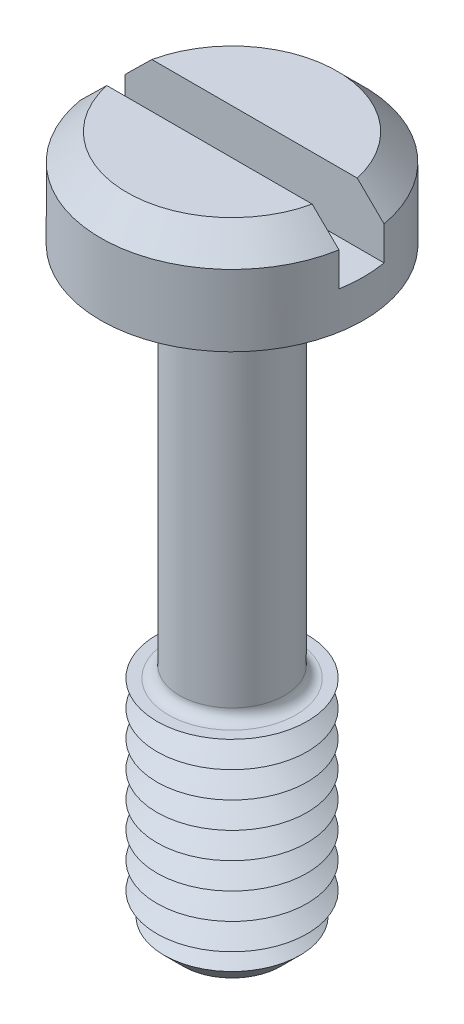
ISO-10303-21;
HEADER;
FILE_DESCRIPTION(('STEP AP214'),'2;1');
FILE_NAME('part.step','',(''),(''),'','','');
FILE_SCHEMA(('AUTOMOTIVE_DESIGN { 1 0 10303 214 1 1 1 1 }'));
ENDSEC;
DATA;
#1=APPLICATION_CONTEXT('core data for automotive mechanical design processes');
#2=APPLICATION_PROTOCOL_DEFINITION('international standard','automotive_design',2000,#1);
#3=PRODUCT_CONTEXT('',#1,'mechanical');
#4=PRODUCT('Part','Part','',(#3));
#5=PRODUCT_RELATED_PRODUCT_CATEGORY('part','',(#4));
#6=PRODUCT_DEFINITION_FORMATION('','',#4);
#7=PRODUCT_DEFINITION_CONTEXT('part definition',#1,'design');
#8=PRODUCT_DEFINITION('design','',#6,#7);
#9=PRODUCT_DEFINITION_SHAPE('','',#8);
#10=(LENGTH_UNIT() NAMED_UNIT(*) SI_UNIT(.MILLI.,.METRE.));
#11=(NAMED_UNIT(*) PLANE_ANGLE_UNIT() SI_UNIT($,.RADIAN.));
#12=(NAMED_UNIT(*) SI_UNIT($,.STERADIAN.) SOLID_ANGLE_UNIT());
#13=UNCERTAINTY_MEASURE_WITH_UNIT(LENGTH_MEASURE(1.E-05),#10,'distance_accuracy_value','');
#14=(GEOMETRIC_REPRESENTATION_CONTEXT(3) GLOBAL_UNCERTAINTY_ASSIGNED_CONTEXT((#13)) GLOBAL_UNIT_ASSIGNED_CONTEXT((#10,
#11,#12)) REPRESENTATION_CONTEXT('',''));
#15=CARTESIAN_POINT('',(0.,0.,0.));
#16=DIRECTION('',(0.,0.,1.));
#17=DIRECTION('',(1.,0.,0.));
#18=AXIS2_PLACEMENT_3D('',#15,#16,#17);
#19=CARTESIAN_POINT('',(0.,2.6,0.));
#20=DIRECTION('',(0.,1.,0.));
#21=DIRECTION('',(0.,0.,1.));
#22=AXIS2_PLACEMENT_3D('',#19,#20,#21);
#23=PLANE('',#22);
#24=DIRECTION('',(-1.,0.,0.));
#25=VECTOR('',#24,1.);
#26=CARTESIAN_POINT('',(3.5,2.6,-0.6));
#27=LINE('',#26,#25);
#28=CARTESIAN_POINT('',(2.73495886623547,2.6,-0.6));
#29=VERTEX_POINT('',#28);
#30=CARTESIAN_POINT('',(-2.73495886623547,2.6,-0.6));
#31=VERTEX_POINT('',#30);
#32=EDGE_CURVE('E110',#29,#31,#27,.T.);
#33=ORIENTED_EDGE('',*,*,#32,.F.);
#34=CARTESIAN_POINT('',(0.,2.6,0.));
#35=DIRECTION('',(0.,1.,0.));
#36=DIRECTION('',(0.,0.,1.));
#37=AXIS2_PLACEMENT_3D('',#34,#35,#36);
#38=CIRCLE('',#37,2.8);
#39=EDGE_CURVE('E113',#29,#31,#38,.T.);
#40=ORIENTED_EDGE('',*,*,#39,.T.);
#41=EDGE_LOOP('',(#33,#40));
#42=FACE_BOUND('',#41,.T.);
#43=ADVANCED_FACE('F39',(#42),#23,.T.);
#44=CARTESIAN_POINT('',(0.,2.6,0.));
#45=DIRECTION('',(0.,-1.,0.));
#46=DIRECTION('',(0.,0.,-1.));
#47=AXIS2_PLACEMENT_3D('',#44,#45,#46);
#48=CONICAL_SURFACE('',#47,2.8,0.785398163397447);
#49=CARTESIAN_POINT('',(7.69779986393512,-2.32114776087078,-0.6));
#50=CARTESIAN_POINT('',(7.42456340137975,-2.0487448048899,-0.6));
#51=CARTESIAN_POINT('',(7.15128998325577,-1.77637887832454,-0.6));
#52=CARTESIAN_POINT('',(6.60460779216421,-1.23176088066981,-0.6));
#53=CARTESIAN_POINT('',(6.3311990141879,-0.959508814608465,-0.6));
#54=CARTESIAN_POINT('',(5.78393918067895,-0.414914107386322,-0.6));
#55=CARTESIAN_POINT('',(5.51008795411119,-0.142571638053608,-0.6));
#56=CARTESIAN_POINT('',(4.96212493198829,0.401829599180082,-0.6));
#57=CARTESIAN_POINT('',(4.68801314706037,0.673888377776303,-0.6));
#58=CARTESIAN_POINT('',(4.15230810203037,1.20471714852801,-0.6));
#59=CARTESIAN_POINT('',(3.89073524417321,1.46350771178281,-0.6));
#60=CARTESIAN_POINT('',(3.49781694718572,1.85115830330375,-0.6));
#61=CARTESIAN_POINT('',(3.36674319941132,1.98029362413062,-0.6));
#62=CARTESIAN_POINT('',(3.10433907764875,2.23830030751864,-0.6));
#63=CARTESIAN_POINT('',(2.97300870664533,2.36717167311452,-0.6));
#64=CARTESIAN_POINT('',(2.71005235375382,2.62445652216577,-0.6));
#65=CARTESIAN_POINT('',(2.57842659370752,2.7528702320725,-0.6));
#66=CARTESIAN_POINT('',(2.31459302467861,3.00911021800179,-0.6));
#67=CARTESIAN_POINT('',(2.1823851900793,3.13693646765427,-0.6));
#68=CARTESIAN_POINT('',(1.91706128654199,3.39159289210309,-0.6));
#69=CARTESIAN_POINT('',(1.78394541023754,3.51842326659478,-0.6));
#70=CARTESIAN_POINT('',(1.5829745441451,3.70728046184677,-0.6));
#71=CARTESIAN_POINT('',(1.51577053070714,3.76999922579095,-0.6));
#72=CARTESIAN_POINT('',(1.38073587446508,3.89475766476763,-0.6));
#73=CARTESIAN_POINT('',(1.31290524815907,3.95679735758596,-0.6));
#74=CARTESIAN_POINT('',(1.20662362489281,4.05253127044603,-0.6));
#75=CARTESIAN_POINT('',(1.16849592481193,4.08658409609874,-0.6));
#76=CARTESIAN_POINT('',(1.09186306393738,4.15427097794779,-0.6));
#77=CARTESIAN_POINT('',(1.05335786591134,4.18790499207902,-0.6));
#78=CARTESIAN_POINT('',(0.975560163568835,4.25487029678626,-0.6));
#79=CARTESIAN_POINT('',(0.93626386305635,4.28819718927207,-0.6));
#80=CARTESIAN_POINT('',(0.857023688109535,4.35405392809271,-0.6));
#81=CARTESIAN_POINT('',(0.81707998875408,4.38658398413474,-0.6));
#82=CARTESIAN_POINT('',(0.735932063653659,4.45080389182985,-0.6));
#83=CARTESIAN_POINT('',(0.694719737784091,4.48248357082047,-0.6));
#84=CARTESIAN_POINT('',(0.611023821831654,4.54411116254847,-0.6));
#85=CARTESIAN_POINT('',(0.568540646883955,4.57405963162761,-0.6));
#86=CARTESIAN_POINT('',(0.482031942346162,4.63104137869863,-0.6));
#87=CARTESIAN_POINT('',(0.438018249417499,4.65809235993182,-0.6));
#88=CARTESIAN_POINT('',(0.347545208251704,4.70764477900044,-0.6));
#89=CARTESIAN_POINT('',(0.301093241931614,4.73015905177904,-0.6));
#90=CARTESIAN_POINT('',(0.216840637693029,4.76288589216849,-0.6));
#91=CARTESIAN_POINT('',(0.179711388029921,4.77476119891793,-0.6));
#92=CARTESIAN_POINT('',(0.104069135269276,4.79214056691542,-0.6));
#93=CARTESIAN_POINT('',(0.0655630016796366,4.79767265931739,-0.6));
#94=CARTESIAN_POINT('',(-0.0121083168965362,4.80113734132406,-0.6));
#95=CARTESIAN_POINT('',(-0.0512762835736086,4.79901215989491,-0.6));
#96=CARTESIAN_POINT('',(-0.128601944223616,4.78758103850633,-0.6));
#97=CARTESIAN_POINT('',(-0.166755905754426,4.77825158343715,-0.6));
#98=CARTESIAN_POINT('',(-0.239985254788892,4.75468984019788,-0.6));
#99=CARTESIAN_POINT('',(-0.275121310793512,4.74063623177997,-0.6));
#100=CARTESIAN_POINT('',(-0.343859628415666,4.70912771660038,-0.6));
#101=CARTESIAN_POINT('',(-0.37745919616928,4.69166709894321,-0.6));
#102=CARTESIAN_POINT('',(-0.443620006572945,4.65431398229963,-0.6));
#103=CARTESIAN_POINT('',(-0.476170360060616,4.63440256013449,-0.6));
#104=CARTESIAN_POINT('',(-0.540208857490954,4.59301144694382,-0.6));
#105=CARTESIAN_POINT('',(-0.571697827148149,4.57153301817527,-0.6));
#106=CARTESIAN_POINT('',(-0.636426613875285,4.5256571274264,-0.6));
#107=CARTESIAN_POINT('',(-0.669598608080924,4.50116466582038,-0.6));
#108=CARTESIAN_POINT('',(-0.735238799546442,4.45125092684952,-0.6));
#109=CARTESIAN_POINT('',(-0.767706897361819,4.42582951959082,-0.6));
#110=CARTESIAN_POINT('',(-0.864340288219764,4.34853769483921,-0.6));
#111=CARTESIAN_POINT('',(-0.927700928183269,4.29566444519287,-0.6));
#112=CARTESIAN_POINT('',(-1.05322030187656,4.18829389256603,-0.6));
#113=CARTESIAN_POINT('',(-1.11537654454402,4.13379371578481,-0.6));
#114=CARTESIAN_POINT('',(-1.23879800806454,4.02383276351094,-0.6));
#115=CARTESIAN_POINT('',(-1.30006349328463,3.96837228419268,-0.6));
#116=CARTESIAN_POINT('',(-1.42182653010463,3.85695373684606,-0.6));
#117=CARTESIAN_POINT('',(-1.48232573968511,3.80099747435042,-0.6));
#118=CARTESIAN_POINT('',(-1.602900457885,3.68862177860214,-0.6));
#119=CARTESIAN_POINT('',(-1.66297593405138,3.63220231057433,-0.6));
#120=CARTESIAN_POINT('',(-1.84259490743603,3.46258196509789,-0.6));
#121=CARTESIAN_POINT('',(-1.96167258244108,3.34888831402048,-0.6));
#122=CARTESIAN_POINT('',(-2.19942862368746,3.12043467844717,-0.6));
#123=CARTESIAN_POINT('',(-2.31810499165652,3.00567262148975,-0.6));
#124=CARTESIAN_POINT('',(-2.55498513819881,2.77566147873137,-0.6));
#125=CARTESIAN_POINT('',(-2.67318891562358,2.66041239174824,-0.6));
#126=CARTESIAN_POINT('',(-3.02733776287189,2.31418176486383,-0.6));
#127=CARTESIAN_POINT('',(-3.26281496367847,2.08272206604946,-0.6));
#128=CARTESIAN_POINT('',(-3.7332660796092,1.61902814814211,-0.6));
#129=CARTESIAN_POINT('',(-3.96823963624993,1.38679356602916,-0.6));
#130=CARTESIAN_POINT('',(-4.43780370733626,0.92194241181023,-0.6));
#131=CARTESIAN_POINT('',(-4.67239422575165,0.6893258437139,-0.6));
#132=CARTESIAN_POINT('',(-5.13982382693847,0.225350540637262,-0.6));
#133=CARTESIAN_POINT('',(-5.37266445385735,-0.00600663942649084,-0.6));
#134=CARTESIAN_POINT('',(-5.83818541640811,-0.468883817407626,-0.6));
#135=CARTESIAN_POINT('',(-6.07086575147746,-0.700403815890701,-0.6));
#136=CARTESIAN_POINT('',(-6.53596926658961,-1.16341429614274,-0.6));
#137=CARTESIAN_POINT('',(-6.76839251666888,-1.39490470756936,-0.6));
#138=CARTESIAN_POINT('',(-7.23315324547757,-1.85796986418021,-0.6));
#139=CARTESIAN_POINT('',(-7.46549072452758,-2.08954460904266,-0.6));
#140=CARTESIAN_POINT('',(-7.69779986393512,-2.32114776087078,-0.6));
#141=B_SPLINE_CURVE_WITH_KNOTS('',3,(#49,#50,#51,#52,#53,#54,#55,#56,#57,#58,#59,#60,#61,#62,
#63,#64,#65,#66,#67,#68,#69,#70,#71,#72,#73,#74,#75,#76,#77,#78,#79,#80,#81,#82,#83,#84,#85,#86,
#87,#88,#89,#90,#91,#92,#93,#94,#95,#96,#97,#98,#99,#100,#101,#102,#103,#104,#105,#106,#107,
#108,#109,#110,#111,#112,#113,#114,#115,#116,#117,#118,#119,#120,#121,#122,#123,#124,#125,#126,
#127,#128,#129,#130,#131,#132,#133,#134,#135,#136,#137,#138,#139,#140),.UNSPECIFIED.,.F.,.F.,(4,
2,2,2,2,2,2,2,2,2,2,2,2,2,2,2,2,2,2,2,2,2,2,2,2,2,2,2,2,2,2,2,2,2,2,2,2,2,2,2,2,2,2,2,2,4),(0.,
1.15747738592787,2.31500139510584,3.47365747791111,4.63226817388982,5.73614050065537,
6.28814234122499,6.84013779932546,7.39180548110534,7.94349768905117,8.49507629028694,
8.77084567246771,9.04660781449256,9.19996738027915,9.35334222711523,9.50791164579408,
9.66243993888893,9.81835637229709,9.9742224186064,10.1290741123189,10.2834813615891,
10.4000294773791,10.5160605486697,10.6329688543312,10.7502603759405,10.8635386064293,
10.9770083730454,11.0914168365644,11.205734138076,11.3294140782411,11.4531113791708,
11.7006314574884,11.9486181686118,12.1965297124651,12.4437540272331,12.6909970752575,
13.184904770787,13.6801705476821,14.1754375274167,15.1659939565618,16.1571087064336,
17.1482131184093,18.1329303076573,19.1176509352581,20.1017623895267,21.0858701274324),.UNSPECIFIED.);
#142=CARTESIAN_POINT('',(3.44818792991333,1.9,-0.6));
#143=VERTEX_POINT('',#142);
#144=EDGE_CURVE('E259',#143,#29,#141,.T.);
#145=ORIENTED_EDGE('',*,*,#144,.F.);
#146=CARTESIAN_POINT('',(0.,1.9,0.));
#147=DIRECTION('',(0.,1.,0.));
#148=DIRECTION('',(0.,0.,1.));
#149=AXIS2_PLACEMENT_3D('',#146,#147,#148);
#150=CIRCLE('',#149,3.5);
#151=CARTESIAN_POINT('',(-3.44818792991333,1.9,-0.6));
#152=VERTEX_POINT('',#151);
#153=EDGE_CURVE('E128',#152,#143,#150,.F.);
#154=ORIENTED_EDGE('',*,*,#153,.F.);
#155=EDGE_CURVE('E102',#31,#152,#141,.T.);
#156=ORIENTED_EDGE('',*,*,#155,.F.);
#157=ORIENTED_EDGE('',*,*,#39,.F.);
#158=EDGE_LOOP('',(#145,#154,#156,#157));
#159=FACE_BOUND('',#158,.T.);
#160=ADVANCED_FACE('F222',(#159),#48,.T.);
#161=CARTESIAN_POINT('',(0.,-16.,0.));
#162=DIRECTION('',(0.,1.,0.));
#163=DIRECTION('',(0.,0.,1.));
#164=AXIS2_PLACEMENT_3D('',#161,#162,#163);
#165=CYLINDRICAL_SURFACE('',#164,1.4);
#166=CARTESIAN_POINT('',(0.,-9.7,0.));
#167=DIRECTION('',(0.,-1.,0.));
#168=DIRECTION('',(0.,0.,-1.));
#169=AXIS2_PLACEMENT_3D('',#166,#167,#168);
#170=CIRCLE('',#169,1.4);
#171=CARTESIAN_POINT('',(0.,-9.7,-1.4));
#172=VERTEX_POINT('',#171);
#173=EDGE_CURVE('E123',#172,#172,#170,.F.);
#174=ORIENTED_EDGE('',*,*,#173,.T.);
#175=EDGE_LOOP('',(#174));
#176=FACE_BOUND('',#175,.T.);
#177=CARTESIAN_POINT('',(0.,-0.300000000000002,0.));
#178=DIRECTION('',(0.,1.,0.));
#179=DIRECTION('',(0.,0.,1.));
#180=AXIS2_PLACEMENT_3D('',#177,#178,#179);
#181=CIRCLE('',#180,1.4);
#182=CARTESIAN_POINT('',(0.,-0.300000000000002,1.4));
#183=VERTEX_POINT('',#182);
#184=EDGE_CURVE('E365',#183,#183,#181,.F.);
#185=ORIENTED_EDGE('',*,*,#184,.T.);
#186=EDGE_LOOP('',(#185));
#187=FACE_BOUND('',#186,.T.);
#188=ADVANCED_FACE('F218',(#176,#187),#165,.T.);
#189=CARTESIAN_POINT('',(0.,2.6,0.));
#190=DIRECTION('',(0.,-1.,0.));
#191=DIRECTION('',(0.,0.,-1.));
#192=AXIS2_PLACEMENT_3D('',#189,#190,#191);
#193=CYLINDRICAL_SURFACE('',#192,3.5);
#194=ORIENTED_EDGE('',*,*,#153,.T.);
#195=DIRECTION('',(0.,-1.,0.));
#196=VECTOR('',#195,1.);
#197=CARTESIAN_POINT('',(3.44818792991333,2.6,-0.6));
#198=LINE('',#197,#196);
#199=CARTESIAN_POINT('',(3.44818792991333,1.,-0.6));
#200=VERTEX_POINT('',#199);
#201=EDGE_CURVE('E64',#143,#200,#198,.T.);
#202=ORIENTED_EDGE('',*,*,#201,.T.);
#203=CARTESIAN_POINT('',(0.,1.,0.));
#204=DIRECTION('',(0.,1.,0.));
#205=DIRECTION('',(0.,0.,1.));
#206=AXIS2_PLACEMENT_3D('',#203,#204,#205);
#207=CIRCLE('',#206,3.5);
#208=CARTESIAN_POINT('',(3.44818792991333,1.,0.6));
#209=VERTEX_POINT('',#208);
#210=EDGE_CURVE('E11',#209,#200,#207,.T.);
#211=ORIENTED_EDGE('',*,*,#210,.F.);
#212=DIRECTION('',(0.,-1.,0.));
#213=VECTOR('',#212,1.);
#214=CARTESIAN_POINT('',(3.44818792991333,2.6,0.6));
#215=LINE('',#214,#213);
#216=CARTESIAN_POINT('',(3.44818792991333,1.9,0.6));
#217=VERTEX_POINT('',#216);
#218=EDGE_CURVE('E276',#209,#217,#215,.F.);
#219=ORIENTED_EDGE('',*,*,#218,.T.);
#220=CARTESIAN_POINT('',(-3.44818792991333,1.9,0.6));
#221=VERTEX_POINT('',#220);
#222=EDGE_CURVE('E120',#217,#221,#150,.F.);
#223=ORIENTED_EDGE('',*,*,#222,.T.);
#224=DIRECTION('',(0.,-1.,0.));
#225=VECTOR('',#224,1.);
#226=CARTESIAN_POINT('',(-3.44818792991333,2.6,0.6));
#227=LINE('',#226,#225);
#228=CARTESIAN_POINT('',(-3.44818792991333,1.,0.6));
#229=VERTEX_POINT('',#228);
#230=EDGE_CURVE('E96',#221,#229,#227,.T.);
#231=ORIENTED_EDGE('',*,*,#230,.T.);
#232=CARTESIAN_POINT('',(-3.44818792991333,1.,-0.6));
#233=VERTEX_POINT('',#232);
#234=EDGE_CURVE('E44',#233,#229,#207,.T.);
#235=ORIENTED_EDGE('',*,*,#234,.F.);
#236=DIRECTION('',(0.,-1.,0.));
#237=VECTOR('',#236,1.);
#238=CARTESIAN_POINT('',(-3.44818792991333,2.6,-0.6));
#239=LINE('',#238,#237);
#240=EDGE_CURVE('E281',#233,#152,#239,.F.);
#241=ORIENTED_EDGE('',*,*,#240,.T.);
#242=EDGE_LOOP('',(#194,#202,#211,#219,#223,#231,#235,#241));
#243=FACE_BOUND('',#242,.T.);
#244=CARTESIAN_POINT('',(0.,0.,0.));
#245=DIRECTION('',(0.,1.,0.));
#246=DIRECTION('',(0.,0.,1.));
#247=AXIS2_PLACEMENT_3D('',#244,#245,#246);
#248=CIRCLE('',#247,3.5);
#249=CARTESIAN_POINT('',(0.,0.,3.5));
#250=VERTEX_POINT('',#249);
#251=EDGE_CURVE('E350',#250,#250,#248,.T.);
#252=ORIENTED_EDGE('',*,*,#251,.T.);
#253=EDGE_LOOP('',(#252));
#254=FACE_BOUND('',#253,.T.);
#255=ADVANCED_FACE('F221',(#243,#254),#193,.T.);
#256=DIRECTION('',(1.,0.,0.));
#257=VECTOR('',#256,1.);
#258=CARTESIAN_POINT('',(3.5,2.6,0.6));
#259=LINE('',#258,#257);
#260=CARTESIAN_POINT('',(-2.73495886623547,2.6,0.6));
#261=VERTEX_POINT('',#260);
#262=CARTESIAN_POINT('',(2.73495886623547,2.6,0.6));
#263=VERTEX_POINT('',#262);
#264=EDGE_CURVE('E56',#261,#263,#259,.T.);
#265=ORIENTED_EDGE('',*,*,#264,.F.);
#266=EDGE_CURVE('E108',#261,#263,#38,.T.);
#267=ORIENTED_EDGE('',*,*,#266,.T.);
#268=EDGE_LOOP('',(#265,#267));
#269=FACE_BOUND('',#268,.T.);
#270=ADVANCED_FACE('F107',(#269),#23,.T.);
#271=CARTESIAN_POINT('',(0.,0.,0.));
#272=DIRECTION('',(0.,1.,0.));
#273=DIRECTION('',(0.,0.,1.));
#274=AXIS2_PLACEMENT_3D('',#271,#272,#273);
#275=PLANE('',#274);
#276=CARTESIAN_POINT('',(0.,0.,0.));
#277=DIRECTION('',(0.,1.,0.));
#278=DIRECTION('',(0.,0.,1.));
#279=AXIS2_PLACEMENT_3D('',#276,#277,#278);
#280=CIRCLE('',#279,1.7);
#281=CARTESIAN_POINT('',(0.,0.,1.7));
#282=VERTEX_POINT('',#281);
#283=EDGE_CURVE('E114',#282,#282,#280,.T.);
#284=ORIENTED_EDGE('',*,*,#283,.T.);
#285=EDGE_LOOP('',(#284));
#286=FACE_BOUND('',#285,.T.);
#287=ORIENTED_EDGE('',*,*,#251,.F.);
#288=EDGE_LOOP('',(#287));
#289=FACE_BOUND('',#288,.T.);
#290=ADVANCED_FACE('F212',(#286,#289),#275,.F.);
#291=CARTESIAN_POINT('',(0.,-10.,0.));
#292=DIRECTION('',(0.,-1.,0.));
#293=DIRECTION('',(0.,0.,-1.));
#294=AXIS2_PLACEMENT_3D('',#291,#292,#293);
#295=PLANE('',#294);
#296=CARTESIAN_POINT('',(0.,-10.,0.));
#297=DIRECTION('',(0.,-1.,0.));
#298=DIRECTION('',(0.,0.,-1.));
#299=AXIS2_PLACEMENT_3D('',#296,#297,#298);
#300=CIRCLE('',#299,1.7);
#301=CARTESIAN_POINT('',(0.,-10.,-1.7));
#302=VERTEX_POINT('',#301);
#303=EDGE_CURVE('E358',#302,#302,#300,.T.);
#304=ORIENTED_EDGE('',*,*,#303,.T.);
#305=EDGE_LOOP('',(#304));
#306=FACE_BOUND('',#305,.T.);
#307=CARTESIAN_POINT('',(0.,-10.,0.));
#308=DIRECTION('',(0.,1.,0.));
#309=DIRECTION('',(0.,0.,1.));
#310=AXIS2_PLACEMENT_3D('',#307,#308,#309);
#311=CIRCLE('',#310,2.);
#312=CARTESIAN_POINT('',(0.,-10.,2.));
#313=VERTEX_POINT('',#312);
#314=EDGE_CURVE('E347',#313,#313,#311,.T.);
#315=ORIENTED_EDGE('',*,*,#314,.T.);
#316=EDGE_LOOP('',(#315));
#317=FACE_BOUND('',#316,.T.);
#318=ADVANCED_FACE('F208',(#306,#317),#295,.F.);
#319=CARTESIAN_POINT('',(0.,-10.35,0.));
#320=DIRECTION('',(0.,1.,0.));
#321=DIRECTION('',(0.,0.,1.));
#322=AXIS2_PLACEMENT_3D('',#319,#320,#321);
#323=CONICAL_SURFACE('',#322,1.3937822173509,1.0471975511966);
#324=ORIENTED_EDGE('',*,*,#314,.F.);
#325=EDGE_LOOP('',(#324));
#326=FACE_BOUND('',#325,.T.);
#327=CARTESIAN_POINT('',(0.,-10.35,0.));
#328=DIRECTION('',(0.,1.,0.));
#329=DIRECTION('',(0.,0.,1.));
#330=AXIS2_PLACEMENT_3D('',#327,#328,#329);
#331=CIRCLE('',#330,1.3937822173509);
#332=CARTESIAN_POINT('',(0.,-10.35,1.3937822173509));
#333=VERTEX_POINT('',#332);
#334=EDGE_CURVE('E344',#333,#333,#331,.T.);
#335=ORIENTED_EDGE('',*,*,#334,.T.);
#336=EDGE_LOOP('',(#335));
#337=FACE_BOUND('',#336,.T.);
#338=ADVANCED_FACE('F204',(#326,#337),#323,.T.);
#339=CARTESIAN_POINT('',(0.,-10.7,0.));
#340=DIRECTION('',(0.,-1.,0.));
#341=DIRECTION('',(0.,0.,-1.));
#342=AXIS2_PLACEMENT_3D('',#339,#340,#341);
#343=CONICAL_SURFACE('',#342,2.,1.0471975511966);
#344=ORIENTED_EDGE('',*,*,#334,.F.);
#345=EDGE_LOOP('',(#344));
#346=FACE_BOUND('',#345,.T.);
#347=CARTESIAN_POINT('',(0.,-10.7,0.));
#348=DIRECTION('',(0.,1.,0.));
#349=DIRECTION('',(0.,0.,1.));
#350=AXIS2_PLACEMENT_3D('',#347,#348,#349);
#351=CIRCLE('',#350,2.);
#352=CARTESIAN_POINT('',(0.,-10.7,2.));
#353=VERTEX_POINT('',#352);
#354=EDGE_CURVE('E340',#353,#353,#351,.T.);
#355=ORIENTED_EDGE('',*,*,#354,.T.);
#356=EDGE_LOOP('',(#355));
#357=FACE_BOUND('',#356,.T.);
#358=ADVANCED_FACE('F200',(#346,#357),#343,.T.);
#359=CARTESIAN_POINT('',(0.,-11.05,0.));
#360=DIRECTION('',(0.,1.,0.));
#361=DIRECTION('',(0.,0.,1.));
#362=AXIS2_PLACEMENT_3D('',#359,#360,#361);
#363=CONICAL_SURFACE('',#362,1.3937822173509,1.0471975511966);
#364=ORIENTED_EDGE('',*,*,#354,.F.);
#365=EDGE_LOOP('',(#364));
#366=FACE_BOUND('',#365,.T.);
#367=CARTESIAN_POINT('',(0.,-11.05,0.));
#368=DIRECTION('',(0.,1.,0.));
#369=DIRECTION('',(0.,0.,1.));
#370=AXIS2_PLACEMENT_3D('',#367,#368,#369);
#371=CIRCLE('',#370,1.3937822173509);
#372=CARTESIAN_POINT('',(0.,-11.05,1.3937822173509));
#373=VERTEX_POINT('',#372);
#374=EDGE_CURVE('E336',#373,#373,#371,.T.);
#375=ORIENTED_EDGE('',*,*,#374,.T.);
#376=EDGE_LOOP('',(#375));
#377=FACE_BOUND('',#376,.T.);
#378=ADVANCED_FACE('F196',(#366,#377),#363,.T.);
#379=CARTESIAN_POINT('',(0.,-11.4,0.));
#380=DIRECTION('',(0.,-1.,0.));
#381=DIRECTION('',(0.,0.,-1.));
#382=AXIS2_PLACEMENT_3D('',#379,#380,#381);
#383=CONICAL_SURFACE('',#382,2.,1.0471975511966);
#384=ORIENTED_EDGE('',*,*,#374,.F.);
#385=EDGE_LOOP('',(#384));
#386=FACE_BOUND('',#385,.T.);
#387=CARTESIAN_POINT('',(0.,-11.4,0.));
#388=DIRECTION('',(0.,1.,0.));
#389=DIRECTION('',(0.,0.,1.));
#390=AXIS2_PLACEMENT_3D('',#387,#388,#389);
#391=CIRCLE('',#390,2.);
#392=CARTESIAN_POINT('',(0.,-11.4,2.));
#393=VERTEX_POINT('',#392);
#394=EDGE_CURVE('E333',#393,#393,#391,.T.);
#395=ORIENTED_EDGE('',*,*,#394,.T.);
#396=EDGE_LOOP('',(#395));
#397=FACE_BOUND('',#396,.T.);
#398=ADVANCED_FACE('F192',(#386,#397),#383,.T.);
#399=CARTESIAN_POINT('',(0.,-11.75,0.));
#400=DIRECTION('',(0.,1.,0.));
#401=DIRECTION('',(0.,0.,1.));
#402=AXIS2_PLACEMENT_3D('',#399,#400,#401);
#403=CONICAL_SURFACE('',#402,1.3937822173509,1.0471975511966);
#404=ORIENTED_EDGE('',*,*,#394,.F.);
#405=EDGE_LOOP('',(#404));
#406=FACE_BOUND('',#405,.T.);
#407=CARTESIAN_POINT('',(0.,-11.75,0.));
#408=DIRECTION('',(0.,1.,0.));
#409=DIRECTION('',(0.,0.,1.));
#410=AXIS2_PLACEMENT_3D('',#407,#408,#409);
#411=CIRCLE('',#410,1.3937822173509);
#412=CARTESIAN_POINT('',(0.,-11.75,1.3937822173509));
#413=VERTEX_POINT('',#412);
#414=EDGE_CURVE('E329',#413,#413,#411,.T.);
#415=ORIENTED_EDGE('',*,*,#414,.T.);
#416=EDGE_LOOP('',(#415));
#417=FACE_BOUND('',#416,.T.);
#418=ADVANCED_FACE('F188',(#406,#417),#403,.T.);
#419=CARTESIAN_POINT('',(0.,-12.1,0.));
#420=DIRECTION('',(0.,-1.,0.));
#421=DIRECTION('',(0.,0.,-1.));
#422=AXIS2_PLACEMENT_3D('',#419,#420,#421);
#423=CONICAL_SURFACE('',#422,2.,1.0471975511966);
#424=ORIENTED_EDGE('',*,*,#414,.F.);
#425=EDGE_LOOP('',(#424));
#426=FACE_BOUND('',#425,.T.);
#427=CARTESIAN_POINT('',(0.,-12.1,0.));
#428=DIRECTION('',(0.,1.,0.));
#429=DIRECTION('',(0.,0.,1.));
#430=AXIS2_PLACEMENT_3D('',#427,#428,#429);
#431=CIRCLE('',#430,2.);
#432=CARTESIAN_POINT('',(0.,-12.1,2.));
#433=VERTEX_POINT('',#432);
#434=EDGE_CURVE('E325',#433,#433,#431,.T.);
#435=ORIENTED_EDGE('',*,*,#434,.T.);
#436=EDGE_LOOP('',(#435));
#437=FACE_BOUND('',#436,.T.);
#438=ADVANCED_FACE('F184',(#426,#437),#423,.T.);
#439=CARTESIAN_POINT('',(0.,-12.45,0.));
#440=DIRECTION('',(0.,1.,0.));
#441=DIRECTION('',(0.,0.,1.));
#442=AXIS2_PLACEMENT_3D('',#439,#440,#441);
#443=CONICAL_SURFACE('',#442,1.3937822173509,1.0471975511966);
#444=ORIENTED_EDGE('',*,*,#434,.F.);
#445=EDGE_LOOP('',(#444));
#446=FACE_BOUND('',#445,.T.);
#447=CARTESIAN_POINT('',(0.,-12.45,0.));
#448=DIRECTION('',(0.,1.,0.));
#449=DIRECTION('',(0.,0.,1.));
#450=AXIS2_PLACEMENT_3D('',#447,#448,#449);
#451=CIRCLE('',#450,1.3937822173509);
#452=CARTESIAN_POINT('',(0.,-12.45,1.3937822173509));
#453=VERTEX_POINT('',#452);
#454=EDGE_CURVE('E321',#453,#453,#451,.T.);
#455=ORIENTED_EDGE('',*,*,#454,.T.);
#456=EDGE_LOOP('',(#455));
#457=FACE_BOUND('',#456,.T.);
#458=ADVANCED_FACE('F180',(#446,#457),#443,.T.);
#459=CARTESIAN_POINT('',(0.,-12.8,0.));
#460=DIRECTION('',(0.,-1.,0.));
#461=DIRECTION('',(0.,0.,-1.));
#462=AXIS2_PLACEMENT_3D('',#459,#460,#461);
#463=CONICAL_SURFACE('',#462,2.,1.0471975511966);
#464=ORIENTED_EDGE('',*,*,#454,.F.);
#465=EDGE_LOOP('',(#464));
#466=FACE_BOUND('',#465,.T.);
#467=CARTESIAN_POINT('',(0.,-12.8,0.));
#468=DIRECTION('',(0.,1.,0.));
#469=DIRECTION('',(0.,0.,1.));
#470=AXIS2_PLACEMENT_3D('',#467,#468,#469);
#471=CIRCLE('',#470,2.);
#472=CARTESIAN_POINT('',(0.,-12.8,2.));
#473=VERTEX_POINT('',#472);
#474=EDGE_CURVE('E317',#473,#473,#471,.T.);
#475=ORIENTED_EDGE('',*,*,#474,.T.);
#476=EDGE_LOOP('',(#475));
#477=FACE_BOUND('',#476,.T.);
#478=ADVANCED_FACE('F176',(#466,#477),#463,.T.);
#479=CARTESIAN_POINT('',(0.,-13.15,0.));
#480=DIRECTION('',(0.,1.,0.));
#481=DIRECTION('',(0.,0.,1.));
#482=AXIS2_PLACEMENT_3D('',#479,#480,#481);
#483=CONICAL_SURFACE('',#482,1.3937822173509,1.0471975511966);
#484=ORIENTED_EDGE('',*,*,#474,.F.);
#485=EDGE_LOOP('',(#484));
#486=FACE_BOUND('',#485,.T.);
#487=CARTESIAN_POINT('',(0.,-13.15,0.));
#488=DIRECTION('',(0.,1.,0.));
#489=DIRECTION('',(0.,0.,1.));
#490=AXIS2_PLACEMENT_3D('',#487,#488,#489);
#491=CIRCLE('',#490,1.3937822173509);
#492=CARTESIAN_POINT('',(0.,-13.15,1.3937822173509));
#493=VERTEX_POINT('',#492);
#494=EDGE_CURVE('E314',#493,#493,#491,.T.);
#495=ORIENTED_EDGE('',*,*,#494,.T.);
#496=EDGE_LOOP('',(#495));
#497=FACE_BOUND('',#496,.T.);
#498=ADVANCED_FACE('F172',(#486,#497),#483,.T.);
#499=CARTESIAN_POINT('',(0.,-13.5,0.));
#500=DIRECTION('',(0.,-1.,0.));
#501=DIRECTION('',(0.,0.,-1.));
#502=AXIS2_PLACEMENT_3D('',#499,#500,#501);
#503=CONICAL_SURFACE('',#502,2.,1.0471975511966);
#504=ORIENTED_EDGE('',*,*,#494,.F.);
#505=EDGE_LOOP('',(#504));
#506=FACE_BOUND('',#505,.T.);
#507=CARTESIAN_POINT('',(0.,-13.5,0.));
#508=DIRECTION('',(0.,1.,0.));
#509=DIRECTION('',(0.,0.,1.));
#510=AXIS2_PLACEMENT_3D('',#507,#508,#509);
#511=CIRCLE('',#510,2.);
#512=CARTESIAN_POINT('',(0.,-13.5,2.));
#513=VERTEX_POINT('',#512);
#514=EDGE_CURVE('E310',#513,#513,#511,.T.);
#515=ORIENTED_EDGE('',*,*,#514,.T.);
#516=EDGE_LOOP('',(#515));
#517=FACE_BOUND('',#516,.T.);
#518=ADVANCED_FACE('F168',(#506,#517),#503,.T.);
#519=CARTESIAN_POINT('',(0.,-13.85,0.));
#520=DIRECTION('',(0.,1.,0.));
#521=DIRECTION('',(0.,0.,1.));
#522=AXIS2_PLACEMENT_3D('',#519,#520,#521);
#523=CONICAL_SURFACE('',#522,1.3937822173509,1.0471975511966);
#524=ORIENTED_EDGE('',*,*,#514,.F.);
#525=EDGE_LOOP('',(#524));
#526=FACE_BOUND('',#525,.T.);
#527=CARTESIAN_POINT('',(0.,-13.85,0.));
#528=DIRECTION('',(0.,1.,0.));
#529=DIRECTION('',(0.,0.,1.));
#530=AXIS2_PLACEMENT_3D('',#527,#528,#529);
#531=CIRCLE('',#530,1.3937822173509);
#532=CARTESIAN_POINT('',(0.,-13.85,1.3937822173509));
#533=VERTEX_POINT('',#532);
#534=EDGE_CURVE('E306',#533,#533,#531,.T.);
#535=ORIENTED_EDGE('',*,*,#534,.T.);
#536=EDGE_LOOP('',(#535));
#537=FACE_BOUND('',#536,.T.);
#538=ADVANCED_FACE('F164',(#526,#537),#523,.T.);
#539=CARTESIAN_POINT('',(0.,-14.2,0.));
#540=DIRECTION('',(0.,-1.,0.));
#541=DIRECTION('',(0.,0.,-1.));
#542=AXIS2_PLACEMENT_3D('',#539,#540,#541);
#543=CONICAL_SURFACE('',#542,2.,1.0471975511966);
#544=ORIENTED_EDGE('',*,*,#534,.F.);
#545=EDGE_LOOP('',(#544));
#546=FACE_BOUND('',#545,.T.);
#547=CARTESIAN_POINT('',(0.,-14.2,0.));
#548=DIRECTION('',(0.,1.,0.));
#549=DIRECTION('',(0.,0.,1.));
#550=AXIS2_PLACEMENT_3D('',#547,#548,#549);
#551=CIRCLE('',#550,2.);
#552=CARTESIAN_POINT('',(0.,-14.2,2.));
#553=VERTEX_POINT('',#552);
#554=EDGE_CURVE('E302',#553,#553,#551,.T.);
#555=ORIENTED_EDGE('',*,*,#554,.T.);
#556=EDGE_LOOP('',(#555));
#557=FACE_BOUND('',#556,.T.);
#558=ADVANCED_FACE('F160',(#546,#557),#543,.T.);
#559=CARTESIAN_POINT('',(0.,-14.55,0.));
#560=DIRECTION('',(0.,1.,0.));
#561=DIRECTION('',(0.,0.,1.));
#562=AXIS2_PLACEMENT_3D('',#559,#560,#561);
#563=CONICAL_SURFACE('',#562,1.3937822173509,1.0471975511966);
#564=ORIENTED_EDGE('',*,*,#554,.F.);
#565=EDGE_LOOP('',(#564));
#566=FACE_BOUND('',#565,.T.);
#567=CARTESIAN_POINT('',(0.,-14.55,0.));
#568=DIRECTION('',(0.,1.,0.));
#569=DIRECTION('',(0.,0.,1.));
#570=AXIS2_PLACEMENT_3D('',#567,#568,#569);
#571=CIRCLE('',#570,1.3937822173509);
#572=CARTESIAN_POINT('',(0.,-14.55,1.3937822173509));
#573=VERTEX_POINT('',#572);
#574=EDGE_CURVE('E298',#573,#573,#571,.T.);
#575=ORIENTED_EDGE('',*,*,#574,.T.);
#576=EDGE_LOOP('',(#575));
#577=FACE_BOUND('',#576,.T.);
#578=ADVANCED_FACE('F156',(#566,#577),#563,.T.);
#579=CARTESIAN_POINT('',(0.,-14.9,0.));
#580=DIRECTION('',(0.,-1.,0.));
#581=DIRECTION('',(0.,0.,-1.));
#582=AXIS2_PLACEMENT_3D('',#579,#580,#581);
#583=CONICAL_SURFACE('',#582,2.,1.0471975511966);
#584=ORIENTED_EDGE('',*,*,#574,.F.);
#585=EDGE_LOOP('',(#584));
#586=FACE_BOUND('',#585,.T.);
#587=CARTESIAN_POINT('',(0.,-14.9,0.));
#588=DIRECTION('',(0.,1.,0.));
#589=DIRECTION('',(0.,0.,1.));
#590=AXIS2_PLACEMENT_3D('',#587,#588,#589);
#591=CIRCLE('',#590,2.);
#592=CARTESIAN_POINT('',(0.,-14.9,2.));
#593=VERTEX_POINT('',#592);
#594=EDGE_CURVE('E294',#593,#593,#591,.T.);
#595=ORIENTED_EDGE('',*,*,#594,.T.);
#596=EDGE_LOOP('',(#595));
#597=FACE_BOUND('',#596,.T.);
#598=ADVANCED_FACE('F152',(#586,#597),#583,.T.);
#599=CARTESIAN_POINT('',(0.,-15.25,0.));
#600=DIRECTION('',(0.,1.,0.));
#601=DIRECTION('',(0.,0.,1.));
#602=AXIS2_PLACEMENT_3D('',#599,#600,#601);
#603=CONICAL_SURFACE('',#602,1.3937822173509,1.0471975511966);
#604=ORIENTED_EDGE('',*,*,#594,.F.);
#605=EDGE_LOOP('',(#604));
#606=FACE_BOUND('',#605,.T.);
#607=CARTESIAN_POINT('',(0.,-15.25,0.));
#608=DIRECTION('',(0.,1.,0.));
#609=DIRECTION('',(0.,0.,1.));
#610=AXIS2_PLACEMENT_3D('',#607,#608,#609);
#611=CIRCLE('',#610,1.3937822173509);
#612=CARTESIAN_POINT('',(0.,-15.25,1.3937822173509));
#613=VERTEX_POINT('',#612);
#614=EDGE_CURVE('E290',#613,#613,#611,.T.);
#615=ORIENTED_EDGE('',*,*,#614,.T.);
#616=EDGE_LOOP('',(#615));
#617=FACE_BOUND('',#616,.T.);
#618=ADVANCED_FACE('F148',(#606,#617),#603,.T.);
#619=CARTESIAN_POINT('',(0.,-15.6,0.));
#620=DIRECTION('',(0.,-1.,0.));
#621=DIRECTION('',(0.,0.,-1.));
#622=AXIS2_PLACEMENT_3D('',#619,#620,#621);
#623=CONICAL_SURFACE('',#622,2.,1.0471975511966);
#624=CARTESIAN_POINT('',(0.,-15.4901923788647,0.));
#625=DIRECTION('',(0.,-1.,0.));
#626=DIRECTION('',(0.,0.,-1.));
#627=AXIS2_PLACEMENT_3D('',#624,#625,#626);
#628=CIRCLE('',#627,1.80980762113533);
#629=CARTESIAN_POINT('',(0.,-15.4901923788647,1.80980762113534));
#630=VERTEX_POINT('',#629);
#631=EDGE_CURVE('E297',#630,#630,#628,.F.);
#632=ORIENTED_EDGE('',*,*,#631,.T.);
#633=EDGE_LOOP('',(#632));
#634=FACE_BOUND('',#633,.T.);
#635=ORIENTED_EDGE('',*,*,#614,.F.);
#636=EDGE_LOOP('',(#635));
#637=FACE_BOUND('',#636,.T.);
#638=ADVANCED_FACE('F144',(#634,#637),#623,.T.);
#639=CARTESIAN_POINT('',(0.,-16.,0.));
#640=DIRECTION('',(0.,-1.,0.));
#641=DIRECTION('',(0.,0.,-1.));
#642=AXIS2_PLACEMENT_3D('',#639,#640,#641);
#643=PLANE('',#642);
#644=CARTESIAN_POINT('',(0.,-16.,0.));
#645=DIRECTION('',(0.,-1.,0.));
#646=DIRECTION('',(0.,0.,-1.));
#647=AXIS2_PLACEMENT_3D('',#644,#645,#646);
#648=CIRCLE('',#647,1.3);
#649=CARTESIAN_POINT('',(0.,-16.,1.30000000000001));
#650=VERTEX_POINT('',#649);
#651=EDGE_CURVE('E354',#650,#650,#648,.T.);
#652=ORIENTED_EDGE('',*,*,#651,.T.);
#653=EDGE_LOOP('',(#652));
#654=FACE_BOUND('',#653,.T.);
#655=ADVANCED_FACE('F147',(#654),#643,.T.);
#656=CARTESIAN_POINT('',(0.,-16.,0.));
#657=DIRECTION('',(0.,1.,0.));
#658=DIRECTION('',(0.,0.,1.));
#659=AXIS2_PLACEMENT_3D('',#656,#657,#658);
#660=CONICAL_SURFACE('',#659,1.3,0.785398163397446);
#661=CARTESIAN_POINT('',(0.,-15.4901923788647,1.80980762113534));
#662=CARTESIAN_POINT('',(0.,-15.4955028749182,1.80449712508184));
#663=CARTESIAN_POINT('',(0.,-15.5008133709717,1.79918662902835));
#664=CARTESIAN_POINT('',(0.,-15.5114343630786,1.78856563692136));
#665=CARTESIAN_POINT('',(0.,-15.5167448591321,1.78325514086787));
#666=CARTESIAN_POINT('',(0.,-15.5273658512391,1.77263414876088));
#667=CARTESIAN_POINT('',(0.,-15.5326763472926,1.76732365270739));
#668=CARTESIAN_POINT('',(0.,-15.5432973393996,1.75670266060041));
#669=CARTESIAN_POINT('',(0.,-15.5486078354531,1.75139216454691));
#670=CARTESIAN_POINT('',(0.,-15.5592288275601,1.74077117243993));
#671=CARTESIAN_POINT('',(0.,-15.5645393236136,1.73546067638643));
#672=CARTESIAN_POINT('',(0.,-15.5751603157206,1.72483968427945));
#673=CARTESIAN_POINT('',(0.,-15.580470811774,1.71952918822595));
#674=CARTESIAN_POINT('',(0.,-15.591091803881,1.70890819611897));
#675=CARTESIAN_POINT('',(0.,-15.5964022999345,1.70359770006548));
#676=CARTESIAN_POINT('',(0.,-15.6070232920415,1.69297670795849));
#677=CARTESIAN_POINT('',(0.,-15.612333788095,1.687666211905));
#678=CARTESIAN_POINT('',(0.,-15.622954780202,1.67704521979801));
#679=CARTESIAN_POINT('',(0.,-15.6282652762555,1.67173472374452));
#680=CARTESIAN_POINT('',(0.,-15.6388862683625,1.66111373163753));
#681=CARTESIAN_POINT('',(0.,-15.644196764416,1.65580323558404));
#682=CARTESIAN_POINT('',(0.,-15.654817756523,1.64518224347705));
#683=CARTESIAN_POINT('',(0.,-15.6601282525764,1.63987174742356));
#684=CARTESIAN_POINT('',(0.,-15.6707492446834,1.62925075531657));
#685=CARTESIAN_POINT('',(0.,-15.6760597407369,1.62394025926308));
#686=CARTESIAN_POINT('',(0.,-15.6866807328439,1.61331926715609));
#687=CARTESIAN_POINT('',(0.,-15.6919912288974,1.6080087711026));
#688=CARTESIAN_POINT('',(0.,-15.7026122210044,1.59738777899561));
#689=CARTESIAN_POINT('',(0.,-15.7079227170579,1.59207728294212));
#690=CARTESIAN_POINT('',(0.,-15.7185437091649,1.58145629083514));
#691=CARTESIAN_POINT('',(0.,-15.7238542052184,1.57614579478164));
#692=CARTESIAN_POINT('',(0.,-15.7344751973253,1.56552480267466));
#693=CARTESIAN_POINT('',(0.,-15.7397856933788,1.56021430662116));
#694=CARTESIAN_POINT('',(0.,-15.7504066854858,1.54959331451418));
#695=CARTESIAN_POINT('',(0.,-15.7557171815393,1.54428281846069));
#696=CARTESIAN_POINT('',(0.,-15.7663381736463,1.5336618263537));
#697=CARTESIAN_POINT('',(0.,-15.7716486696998,1.52835133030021));
#698=CARTESIAN_POINT('',(0.,-15.7822696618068,1.51773033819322));
#699=CARTESIAN_POINT('',(0.,-15.7875801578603,1.51241984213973));
#700=CARTESIAN_POINT('',(0.,-15.7982011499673,1.50179885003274));
#701=CARTESIAN_POINT('',(0.,-15.8035116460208,1.49648835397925));
#702=CARTESIAN_POINT('',(0.,-15.8141326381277,1.48586736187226));
#703=CARTESIAN_POINT('',(0.,-15.8194431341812,1.48055686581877));
#704=CARTESIAN_POINT('',(0.,-15.8300641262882,1.46993587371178));
#705=CARTESIAN_POINT('',(0.,-15.8353746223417,1.46462537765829));
#706=CARTESIAN_POINT('',(0.,-15.8459956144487,1.4540043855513));
#707=CARTESIAN_POINT('',(0.,-15.8513061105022,1.44869388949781));
#708=CARTESIAN_POINT('',(0.,-15.8619271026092,1.43807289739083));
#709=CARTESIAN_POINT('',(0.,-15.8672375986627,1.43276240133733));
#710=CARTESIAN_POINT('',(0.,-15.8778585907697,1.42214140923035));
#711=CARTESIAN_POINT('',(0.,-15.8831690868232,1.41683091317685));
#712=CARTESIAN_POINT('',(0.,-15.8937900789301,1.40620992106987));
#713=CARTESIAN_POINT('',(0.,-15.8991005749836,1.40089942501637));
#714=CARTESIAN_POINT('',(0.,-15.9097215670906,1.39027843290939));
#715=CARTESIAN_POINT('',(0.,-15.9150320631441,1.38496793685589));
#716=CARTESIAN_POINT('',(0.,-15.9256530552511,1.37434694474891));
#717=CARTESIAN_POINT('',(0.,-15.9309635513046,1.36903644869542));
#718=CARTESIAN_POINT('',(0.,-15.9415845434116,1.35841545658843));
#719=CARTESIAN_POINT('',(0.,-15.9468950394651,1.35310496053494));
#720=CARTESIAN_POINT('',(0.,-15.9575160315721,1.34248396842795));
#721=CARTESIAN_POINT('',(0.,-15.9628265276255,1.33717347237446));
#722=CARTESIAN_POINT('',(0.,-15.9734475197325,1.32655248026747));
#723=CARTESIAN_POINT('',(0.,-15.978758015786,1.32124198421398));
#724=CARTESIAN_POINT('',(0.,-15.989379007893,1.31062099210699));
#725=CARTESIAN_POINT('',(0.,-15.9946895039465,1.3053104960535));
#726=CARTESIAN_POINT('',(0.,-16.,1.30000000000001));
#727=B_SPLINE_CURVE_WITH_KNOTS('',3,(#661,#662,#663,#664,#665,#666,#667,#668,#669,#670,#671,
#672,#673,#674,#675,#676,#677,#678,#679,#680,#681,#682,#683,#684,#685,#686,#687,#688,#689,#690,
#691,#692,#693,#694,#695,#696,#697,#698,#699,#700,#701,#702,#703,#704,#705,#706,#707,#708,#709,
#710,#711,#712,#713,#714,#715,#716,#717,#718,#719,#720,#721,#722,#723,#724,#725,#726),
.UNSPECIFIED.,.F.,.F.,(4,2,2,2,2,2,2,2,2,2,2,2,2,2,2,2,2,2,2,2,2,2,2,2,2,2,2,2,2,2,2,2,4),(0.,
0.0225305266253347,0.0450610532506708,0.0675915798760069,0.0901221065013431,0.112652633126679,
0.135183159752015,0.157713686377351,0.180244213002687,0.202774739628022,0.225305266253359,
0.247835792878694,0.270366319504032,0.292896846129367,0.315427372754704,0.337957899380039,
0.360488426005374,0.383018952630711,0.405549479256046,0.428080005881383,0.450610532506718,
0.473141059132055,0.49567158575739,0.518202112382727,0.540732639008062,0.563263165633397,
0.585793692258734,0.608324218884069,0.630854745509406,0.653385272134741,0.675915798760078,
0.698446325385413,0.720976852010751),.UNSPECIFIED.);
#728=EDGE_CURVE('BSEAM216',#630,#650,#727,.T.);
#729=ORIENTED_EDGE('',*,*,#631,.F.);
#730=ORIENTED_EDGE('',*,*,#651,.F.);
#731=ORIENTED_EDGE('',*,*,#728,.T.);
#732=ORIENTED_EDGE('',*,*,#728,.F.);
#733=EDGE_LOOP('',(#729,#731,#730,#732));
#734=FACE_BOUND('',#733,.T.);
#735=ADVANCED_FACE('F216',(#734),#660,.T.);
#736=CARTESIAN_POINT('',(0.,-9.7,0.));
#737=DIRECTION('',(0.,-1.,0.));
#738=DIRECTION('',(0.,0.,-1.));
#739=AXIS2_PLACEMENT_3D('',#736,#737,#738);
#740=TOROIDAL_SURFACE('',#739,1.7,0.3);
#741=ORIENTED_EDGE('',*,*,#173,.F.);
#742=EDGE_LOOP('',(#741));
#743=FACE_BOUND('',#742,.T.);
#744=ORIENTED_EDGE('',*,*,#303,.F.);
#745=EDGE_LOOP('',(#744));
#746=FACE_BOUND('',#745,.T.);
#747=ADVANCED_FACE('F234',(#743,#746),#740,.F.);
#748=CARTESIAN_POINT('',(0.,-0.300000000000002,0.));
#749=DIRECTION('',(0.,1.,0.));
#750=DIRECTION('',(0.,0.,1.));
#751=AXIS2_PLACEMENT_3D('',#748,#749,#750);
#752=TOROIDAL_SURFACE('',#751,1.7,0.3);
#753=ORIENTED_EDGE('',*,*,#283,.F.);
#754=EDGE_LOOP('',(#753));
#755=FACE_BOUND('',#754,.T.);
#756=ORIENTED_EDGE('',*,*,#184,.F.);
#757=EDGE_LOOP('',(#756));
#758=FACE_BOUND('',#757,.T.);
#759=ADVANCED_FACE('F237',(#755,#758),#752,.F.);
#760=CARTESIAN_POINT('',(-7.69779986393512,-2.32114776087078,0.6));
#761=CARTESIAN_POINT('',(-7.42456340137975,-2.0487448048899,0.6));
#762=CARTESIAN_POINT('',(-7.15128998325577,-1.77637887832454,0.6));
#763=CARTESIAN_POINT('',(-6.60460779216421,-1.23176088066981,0.6));
#764=CARTESIAN_POINT('',(-6.33119901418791,-0.959508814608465,0.6));
#765=CARTESIAN_POINT('',(-5.78393918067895,-0.414914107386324,0.6));
#766=CARTESIAN_POINT('',(-5.51008795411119,-0.142571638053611,0.6));
#767=CARTESIAN_POINT('',(-4.96212493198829,0.401829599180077,0.6));
#768=CARTESIAN_POINT('',(-4.68801314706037,0.673888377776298,0.6));
#769=CARTESIAN_POINT('',(-4.15230810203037,1.204717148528,0.6));
#770=CARTESIAN_POINT('',(-3.89073524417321,1.46350771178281,0.6));
#771=CARTESIAN_POINT('',(-3.49781694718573,1.85115830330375,0.6));
#772=CARTESIAN_POINT('',(-3.36674319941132,1.98029362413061,0.6));
#773=CARTESIAN_POINT('',(-3.10433907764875,2.23830030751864,0.6));
#774=CARTESIAN_POINT('',(-2.97300870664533,2.36717167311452,0.6));
#775=CARTESIAN_POINT('',(-2.71005235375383,2.62445652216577,0.6));
#776=CARTESIAN_POINT('',(-2.57842659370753,2.75287023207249,0.6));
#777=CARTESIAN_POINT('',(-2.31459302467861,3.00911021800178,0.6));
#778=CARTESIAN_POINT('',(-2.1823851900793,3.13693646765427,0.6));
#779=CARTESIAN_POINT('',(-1.91706128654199,3.39159289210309,0.6));
#780=CARTESIAN_POINT('',(-1.78394541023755,3.51842326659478,0.6));
#781=CARTESIAN_POINT('',(-1.5829745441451,3.70728046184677,0.6));
#782=CARTESIAN_POINT('',(-1.51577053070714,3.76999922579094,0.6));
#783=CARTESIAN_POINT('',(-1.38073587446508,3.89475766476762,0.6));
#784=CARTESIAN_POINT('',(-1.31290524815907,3.95679735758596,0.6));
#785=CARTESIAN_POINT('',(-1.20662362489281,4.05253127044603,0.6));
#786=CARTESIAN_POINT('',(-1.16849592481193,4.08658409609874,0.6));
#787=CARTESIAN_POINT('',(-1.09186306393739,4.15427097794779,0.6));
#788=CARTESIAN_POINT('',(-1.05335786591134,4.18790499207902,0.6));
#789=CARTESIAN_POINT('',(-0.975560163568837,4.25487029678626,0.6));
#790=CARTESIAN_POINT('',(-0.936263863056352,4.28819718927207,0.6));
#791=CARTESIAN_POINT('',(-0.857023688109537,4.35405392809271,0.6));
#792=CARTESIAN_POINT('',(-0.817079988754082,4.38658398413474,0.6));
#793=CARTESIAN_POINT('',(-0.735932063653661,4.45080389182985,0.6));
#794=CARTESIAN_POINT('',(-0.694719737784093,4.48248357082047,0.6));
#795=CARTESIAN_POINT('',(-0.611023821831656,4.54411116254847,0.6));
#796=CARTESIAN_POINT('',(-0.568540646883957,4.57405963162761,0.6));
#797=CARTESIAN_POINT('',(-0.482031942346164,4.63104137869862,0.6));
#798=CARTESIAN_POINT('',(-0.4380182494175,4.65809235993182,0.6));
#799=CARTESIAN_POINT('',(-0.347545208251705,4.70764477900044,0.6));
#800=CARTESIAN_POINT('',(-0.301093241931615,4.73015905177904,0.6));
#801=CARTESIAN_POINT('',(-0.21684063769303,4.76288589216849,0.6));
#802=CARTESIAN_POINT('',(-0.179711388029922,4.77476119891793,0.6));
#803=CARTESIAN_POINT('',(-0.104069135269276,4.79214056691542,0.6));
#804=CARTESIAN_POINT('',(-0.0655630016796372,4.79767265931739,0.6));
#805=CARTESIAN_POINT('',(0.0121083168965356,4.80113734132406,0.6));
#806=CARTESIAN_POINT('',(0.0512762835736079,4.79901215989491,0.6));
#807=CARTESIAN_POINT('',(0.128601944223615,4.78758103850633,0.6));
#808=CARTESIAN_POINT('',(0.166755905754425,4.77825158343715,0.6));
#809=CARTESIAN_POINT('',(0.239985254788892,4.75468984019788,0.6));
#810=CARTESIAN_POINT('',(0.275121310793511,4.74063623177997,0.6));
#811=CARTESIAN_POINT('',(0.343859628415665,4.70912771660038,0.6));
#812=CARTESIAN_POINT('',(0.377459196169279,4.69166709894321,0.6));
#813=CARTESIAN_POINT('',(0.443620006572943,4.65431398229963,0.6));
#814=CARTESIAN_POINT('',(0.476170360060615,4.63440256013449,0.6));
#815=CARTESIAN_POINT('',(0.540208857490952,4.59301144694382,0.6));
#816=CARTESIAN_POINT('',(0.571697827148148,4.57153301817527,0.6));
#817=CARTESIAN_POINT('',(0.636426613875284,4.5256571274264,0.6));
#818=CARTESIAN_POINT('',(0.669598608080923,4.50116466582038,0.6));
#819=CARTESIAN_POINT('',(0.735238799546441,4.45125092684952,0.6));
#820=CARTESIAN_POINT('',(0.767706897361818,4.42582951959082,0.6));
#821=CARTESIAN_POINT('',(0.864340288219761,4.34853769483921,0.6));
#822=CARTESIAN_POINT('',(0.927700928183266,4.29566444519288,0.6));
#823=CARTESIAN_POINT('',(1.05322030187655,4.18829389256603,0.6));
#824=CARTESIAN_POINT('',(1.11537654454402,4.13379371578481,0.6));
#825=CARTESIAN_POINT('',(1.23879800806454,4.02383276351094,0.6));
#826=CARTESIAN_POINT('',(1.30006349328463,3.96837228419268,0.6));
#827=CARTESIAN_POINT('',(1.42182653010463,3.85695373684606,0.6));
#828=CARTESIAN_POINT('',(1.48232573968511,3.80099747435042,0.6));
#829=CARTESIAN_POINT('',(1.60290045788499,3.68862177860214,0.6));
#830=CARTESIAN_POINT('',(1.66297593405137,3.63220231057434,0.6));
#831=CARTESIAN_POINT('',(1.84259490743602,3.46258196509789,0.6));
#832=CARTESIAN_POINT('',(1.96167258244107,3.34888831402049,0.6));
#833=CARTESIAN_POINT('',(2.19942862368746,3.12043467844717,0.6));
#834=CARTESIAN_POINT('',(2.31810499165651,3.00567262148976,0.6));
#835=CARTESIAN_POINT('',(2.5549851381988,2.77566147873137,0.6));
#836=CARTESIAN_POINT('',(2.67318891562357,2.66041239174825,0.6));
#837=CARTESIAN_POINT('',(3.02733776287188,2.31418176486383,0.6));
#838=CARTESIAN_POINT('',(3.26281496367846,2.08272206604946,0.6));
#839=CARTESIAN_POINT('',(3.73326607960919,1.61902814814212,0.6));
#840=CARTESIAN_POINT('',(3.96823963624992,1.38679356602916,0.6));
#841=CARTESIAN_POINT('',(4.43780370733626,0.921942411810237,0.6));
#842=CARTESIAN_POINT('',(4.67239422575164,0.689325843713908,0.6));
#843=CARTESIAN_POINT('',(5.13982382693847,0.225350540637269,0.6));
#844=CARTESIAN_POINT('',(5.37266445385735,-0.0060066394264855,0.6));
#845=CARTESIAN_POINT('',(5.83818541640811,-0.468883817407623,0.6));
#846=CARTESIAN_POINT('',(6.07086575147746,-0.700403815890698,0.6));
#847=CARTESIAN_POINT('',(6.53596926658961,-1.16341429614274,0.6));
#848=CARTESIAN_POINT('',(6.76839251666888,-1.39490470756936,0.6));
#849=CARTESIAN_POINT('',(7.23315324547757,-1.85796986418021,0.6));
#850=CARTESIAN_POINT('',(7.46549072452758,-2.08954460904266,0.6));
#851=CARTESIAN_POINT('',(7.69779986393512,-2.32114776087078,0.6));
#852=B_SPLINE_CURVE_WITH_KNOTS('',3,(#760,#761,#762,#763,#764,#765,#766,#767,#768,#769,#770,
#771,#772,#773,#774,#775,#776,#777,#778,#779,#780,#781,#782,#783,#784,#785,#786,#787,#788,#789,
#790,#791,#792,#793,#794,#795,#796,#797,#798,#799,#800,#801,#802,#803,#804,#805,#806,#807,#808,
#809,#810,#811,#812,#813,#814,#815,#816,#817,#818,#819,#820,#821,#822,#823,#824,#825,#826,#827,
#828,#829,#830,#831,#832,#833,#834,#835,#836,#837,#838,#839,#840,#841,#842,#843,#844,#845,#846,
#847,#848,#849,#850,#851),.UNSPECIFIED.,.F.,.F.,(4,2,2,2,2,2,2,2,2,2,2,2,2,2,2,2,2,2,2,2,2,2,2,
2,2,2,2,2,2,2,2,2,2,2,2,2,2,2,2,2,2,2,2,2,2,4),(0.,1.15747738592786,2.31500139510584,
3.4736574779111,4.63226817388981,5.73614050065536,6.28814234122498,6.84013779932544,
7.39180548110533,7.94349768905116,8.49507629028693,8.77084567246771,9.04660781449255,
9.19996738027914,9.35334222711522,9.50791164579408,9.66243993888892,9.81835637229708,
9.97422241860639,10.1290741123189,10.2834813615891,10.4000294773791,10.5160605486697,
10.6329688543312,10.7502603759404,10.8635386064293,10.9770083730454,11.0914168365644,
11.205734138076,11.3294140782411,11.4531113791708,11.7006314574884,11.9486181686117,
12.1965297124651,12.4437540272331,12.6909970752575,13.184904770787,13.6801705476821,
14.1754375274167,15.1659939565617,16.1571087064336,17.1482131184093,18.1329303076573,
19.1176509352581,20.1017623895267,21.0858701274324),.UNSPECIFIED.);
#853=EDGE_CURVE('E92',#221,#261,#852,.T.);
#854=ORIENTED_EDGE('',*,*,#853,.F.);
#855=ORIENTED_EDGE('',*,*,#222,.F.);
#856=EDGE_CURVE('E103',#263,#217,#852,.T.);
#857=ORIENTED_EDGE('',*,*,#856,.F.);
#858=ORIENTED_EDGE('',*,*,#266,.F.);
#859=EDGE_LOOP('',(#854,#855,#857,#858));
#860=FACE_BOUND('',#859,.T.);
#861=ADVANCED_FACE('F41',(#860),#48,.T.);
#862=CARTESIAN_POINT('',(0.,1.,0.));
#863=DIRECTION('',(0.,1.,0.));
#864=DIRECTION('',(0.,0.,1.));
#865=AXIS2_PLACEMENT_3D('',#862,#863,#864);
#866=PLANE('',#865);
#867=DIRECTION('',(1.,0.,0.));
#868=VECTOR('',#867,1.);
#869=CARTESIAN_POINT('',(3.5,1.,0.6));
#870=LINE('',#869,#868);
#871=EDGE_CURVE('E256',#229,#209,#870,.T.);
#872=ORIENTED_EDGE('',*,*,#871,.T.);
#873=ORIENTED_EDGE('',*,*,#210,.T.);
#874=DIRECTION('',(-1.,0.,0.));
#875=VECTOR('',#874,1.);
#876=CARTESIAN_POINT('',(3.5,1.,-0.6));
#877=LINE('',#876,#875);
#878=EDGE_CURVE('E273',#200,#233,#877,.T.);
#879=ORIENTED_EDGE('',*,*,#878,.T.);
#880=ORIENTED_EDGE('',*,*,#234,.T.);
#881=EDGE_LOOP('',(#872,#873,#879,#880));
#882=FACE_BOUND('',#881,.T.);
#883=ADVANCED_FACE('F244',(#882),#866,.T.);
#884=CARTESIAN_POINT('',(3.5,1.,-0.6));
#885=DIRECTION('',(0.,0.,-1.));
#886=DIRECTION('',(-1.,0.,0.));
#887=AXIS2_PLACEMENT_3D('',#884,#885,#886);
#888=PLANE('',#887);
#889=ORIENTED_EDGE('',*,*,#144,.T.);
#890=ORIENTED_EDGE('',*,*,#32,.T.);
#891=ORIENTED_EDGE('',*,*,#155,.T.);
#892=ORIENTED_EDGE('',*,*,#240,.F.);
#893=ORIENTED_EDGE('',*,*,#878,.F.);
#894=ORIENTED_EDGE('',*,*,#201,.F.);
#895=EDGE_LOOP('',(#889,#890,#891,#892,#893,#894));
#896=FACE_BOUND('',#895,.T.);
#897=ADVANCED_FACE('F141',(#896),#888,.F.);
#898=CARTESIAN_POINT('',(3.5,1.,0.6));
#899=DIRECTION('',(0.,0.,1.));
#900=DIRECTION('',(1.,0.,0.));
#901=AXIS2_PLACEMENT_3D('',#898,#899,#900);
#902=PLANE('',#901);
#903=ORIENTED_EDGE('',*,*,#853,.T.);
#904=ORIENTED_EDGE('',*,*,#264,.T.);
#905=ORIENTED_EDGE('',*,*,#856,.T.);
#906=ORIENTED_EDGE('',*,*,#218,.F.);
#907=ORIENTED_EDGE('',*,*,#871,.F.);
#908=ORIENTED_EDGE('',*,*,#230,.F.);
#909=EDGE_LOOP('',(#903,#904,#905,#906,#907,#908));
#910=FACE_BOUND('',#909,.T.);
#911=ADVANCED_FACE('F93',(#910),#902,.F.);
#912=CLOSED_SHELL('',(#43,#160,#188,#255,#270,#290,#318,#338,#358,#378,#398,#418,#438,#458,#478,
#498,#518,#538,#558,#578,#598,#618,#638,#655,#735,#747,#759,#861,#883,#897,#911));
#913=MANIFOLD_SOLID_BREP('B2',#912);
#914=ADVANCED_BREP_SHAPE_REPRESENTATION('',(#18,#913),#14);
#915=SHAPE_DEFINITION_REPRESENTATION(#9,#914);
ENDSEC;
END-ISO-10303-21;
